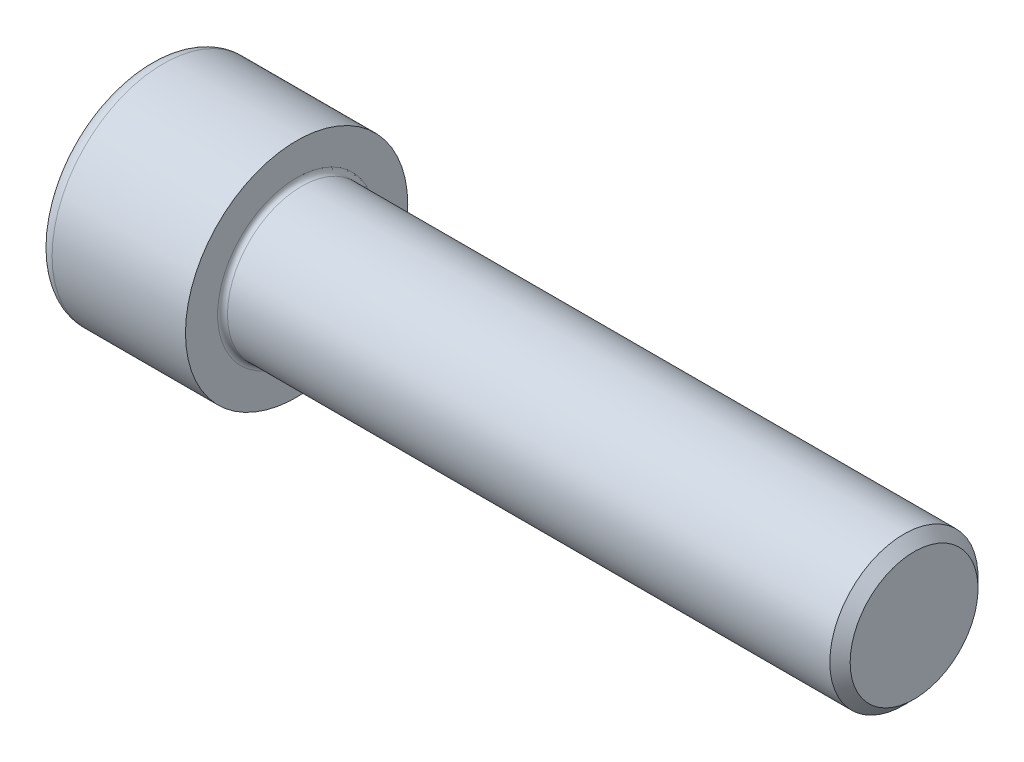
from build123d import *

# Parameters (mm, degrees)
BASEHEADSKE_R   = 18
BASEHEAD_DEPTH  = 24
CUTSOCKET_DEPTH = 12
FILLET1_R       = 0.8
FILLET2_R       = 2.4


with BuildPart() as part:
    # BaseHeadSke → BaseHead (new body)
    with BuildSketch(Plane(origin=(0, 0, 0), x_dir=(0, 0, -1), z_dir=(1, 0, 0))):
        Circle(BASEHEADSKE_R)
    extrude(amount=BASEHEAD_DEPTH)

    # BodySke → BaseBody (revolve)
    with BuildSketch(Plane.XY, mode=Mode.PRIVATE) as basebody_sk:
        Polygon((0, 0), (124, 0), (124, 10.352), (122.352, 12), (0, 12), align=None)
    revolve(basebody_sk.sketch.rotate(Axis((0, 0, 0), (1, 0, 0)), 90), axis=Axis((0, 0, 0), (1, 0, 0)))

    # CutSocketSke → CutSocket (cut)
    with BuildSketch(Plane(origin=(0, 0, 0), x_dir=(0, 0, -1), z_dir=(1, 0, 0))):
        Polygon((0, 10.969655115), (-9.5, 5.484827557), (-9.5, -5.484827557), (0, -10.969655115), (9.5, -5.484827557), (9.5, 5.484827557), align=None)
    extrude(amount=CUTSOCKET_DEPTH, mode=Mode.SUBTRACT)

    # CutHoleSke → CutHole (revolve, cut)
    with BuildSketch(Plane.XY, mode=Mode.PRIVATE) as cuthole_sk:
        Polygon((0, 9.5), (13.6, 9.5), (19.084827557, 0), (0, 0), align=None)
    revolve(cuthole_sk.sketch.rotate(Axis((0, 0, 0), (1, 0, 0)), 90), axis=Axis((0, 0, 0), (1, 0, 0)), mode=Mode.SUBTRACT)

    # Fillet1
    fillet1_edges = [part.edges().sort_by_distance(p)[0] for p in [
        (24, 0, -12),
    ]]
    fillet(fillet1_edges, radius=FILLET1_R)

    # Fillet2
    fillet2_edges = [part.edges().sort_by_distance(p)[0] for p in [
        (0, 0, 18),
    ]]
    fillet(fillet2_edges, radius=FILLET2_R)


solid = part.part
